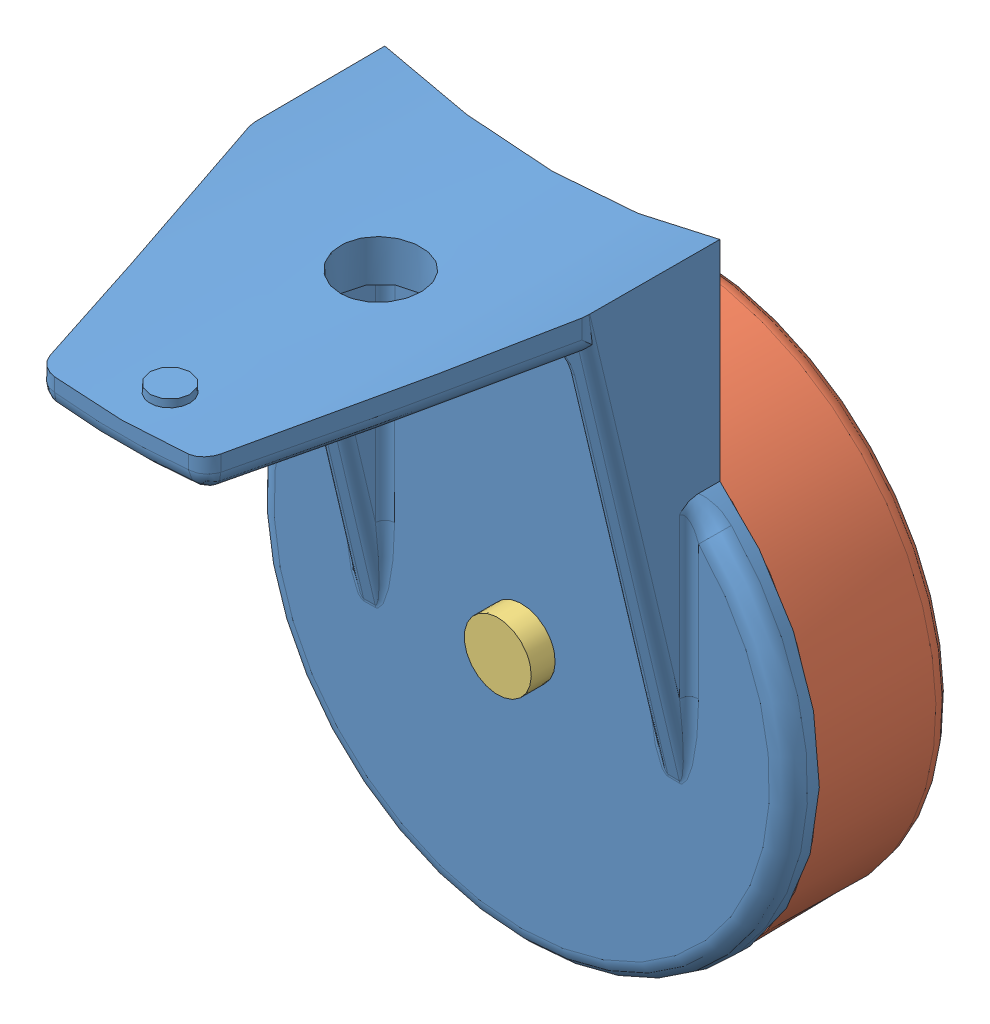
SolidWorks assembly Tasseur.SLDASM, configuration Défaut (file format 4100). Lengths in mm.
Overall size (60.66 73.99 63.3).
3 component instances, 3 part files, 4 mates.
Components (placement in the parent):
- Support de tasseur-1: Support de tasseur.SLDPRT [Défaut] at (0 -279.0641 -5.925) x (0 1 0) z (0 0 1) size (71.56 55.8 48.2)
- Boitier de tasseur-1: Boitier de tasseur.SLDPRT [Défaut] at (0 -380.7867 -5.925) x (0.995537 0.094375 0) z (-0.094375 0.995537 0) size (55.66 18.3 55.66)
- Vis EJOT PT PLUS WN 1447K 40 x 12 Zn-1: Vis EJOT PT PLUS WN 1447K 40 x 12 Zn.SLDPRT [Défaut] at (0 -380.7867 -2.725) x (-0.923728 -0.383049 0) z (0 0 -1) size (7 7 14.5)
Mates (geometry in assembly coordinates):
- Coaxiale1: concentric anti-aligned: cylinder of Support de tasseur-1; cone of Boitier de tasseur-1
- Coïncidente1: coincident anti-aligned: plane of Support de tasseur-1 through (0 -279.0641 -5.925) normal (0 0 -1); plane of Boitier de tasseur-1 through (24.8884 -378.4274 -5.925) normal (0 0 1)
- Coïncidente2: coincident anti-aligned: plane of Support de tasseur-1 through (0 -380.7867 -2.725) normal (0 0 1); plane of Vis EJOT PT PLUS WN 1447K 40 x 12 Zn-1 through (0 -380.7867 -2.725) normal (0 0 -1)
- Coaxiale2: concentric anti-aligned: cone of Boitier de tasseur-1; cylinder of Vis EJOT PT PLUS WN 1447K 40 x 12 Zn-1
